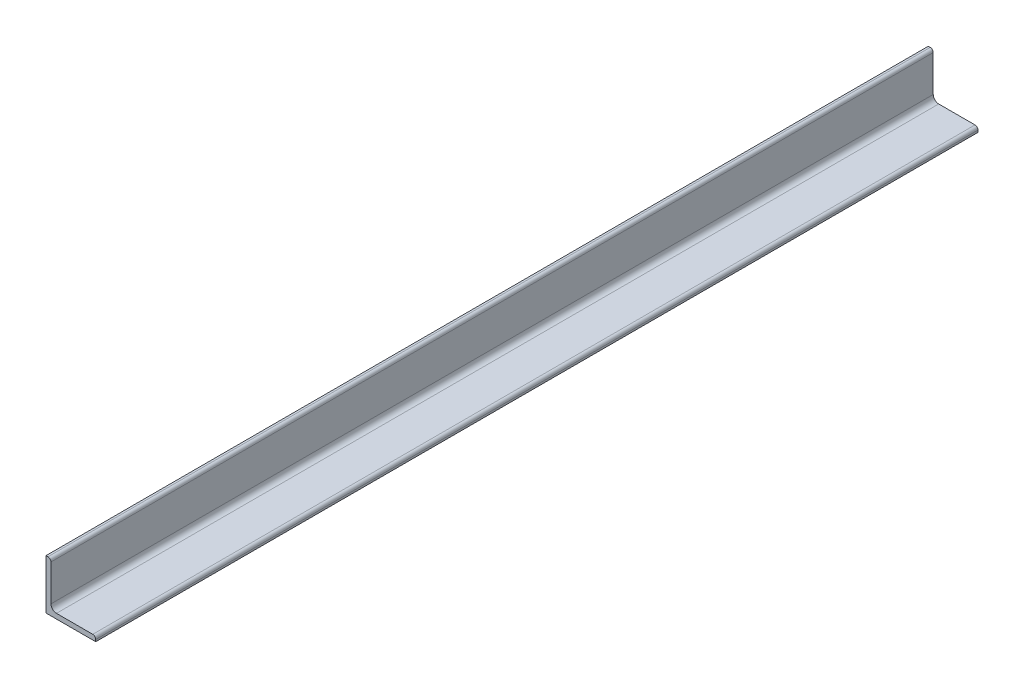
from build123d import *

# Parameters (mm, degrees)
EXTRUDE_1_DEPTH = 887


with BuildPart() as part:
    # Sketch 1 → Extrude 1 (new body)
    with BuildSketch(Plane.XY):
        with BuildLine():
            Line((0, 50), (0, 0))
            Line((0, 0), (50, 0))
            Line((50, 0), (50, 2))
            ThreePointArc((50, 2), (49.121320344, 4.121320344), (47, 5))
            Line((47, 5), (10.5, 5))
            ThreePointArc((10.5, 5), (6.610912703, 6.610912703), (5, 10.5))
            Line((5, 10.5), (5, 47))
            ThreePointArc((5, 47), (4.121320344, 49.121320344), (2, 50))
            Line((2, 50), (0, 50))
        make_face()
    extrude(amount=EXTRUDE_1_DEPTH)


solid = part.part
